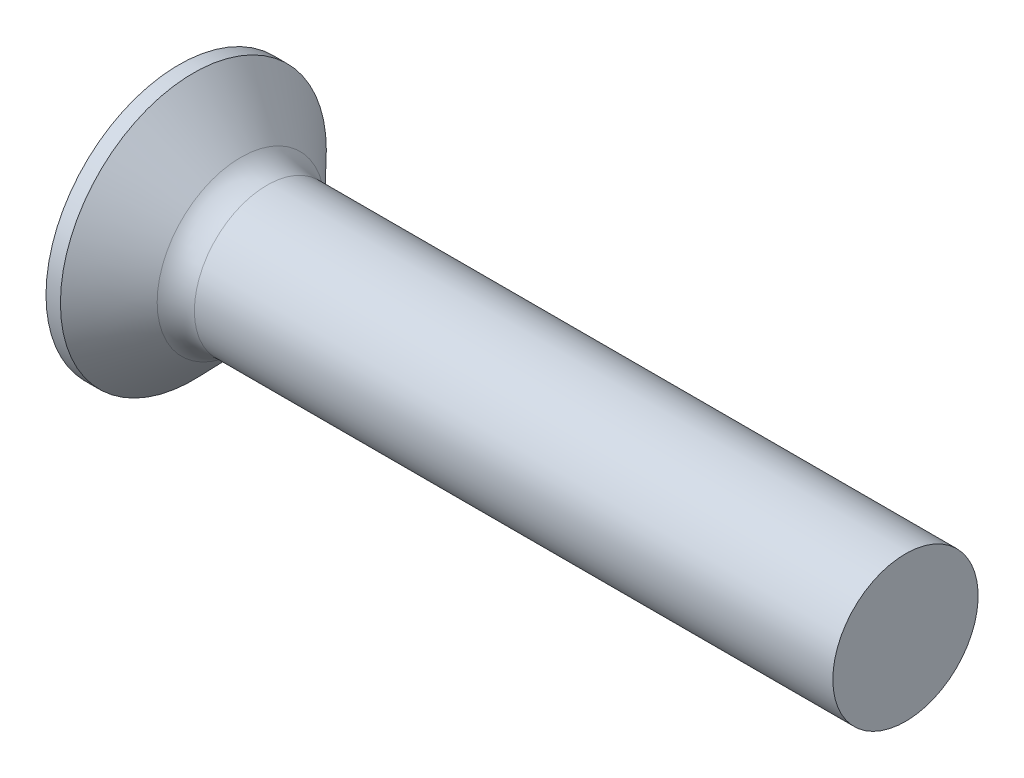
ISO-10303-21;
HEADER;
FILE_DESCRIPTION(('STEP AP214'),'2;1');
FILE_NAME('part.step','',(''),(''),'','','');
FILE_SCHEMA(('AUTOMOTIVE_DESIGN { 1 0 10303 214 1 1 1 1 }'));
ENDSEC;
DATA;
#1=APPLICATION_CONTEXT('core data for automotive mechanical design processes');
#2=APPLICATION_PROTOCOL_DEFINITION('international standard','automotive_design',2000,#1);
#3=PRODUCT_CONTEXT('',#1,'mechanical');
#4=PRODUCT('Part','Part','',(#3));
#5=PRODUCT_RELATED_PRODUCT_CATEGORY('part','',(#4));
#6=PRODUCT_DEFINITION_FORMATION('','',#4);
#7=PRODUCT_DEFINITION_CONTEXT('part definition',#1,'design');
#8=PRODUCT_DEFINITION('design','',#6,#7);
#9=PRODUCT_DEFINITION_SHAPE('','',#8);
#10=(LENGTH_UNIT() NAMED_UNIT(*) SI_UNIT(.MILLI.,.METRE.));
#11=(NAMED_UNIT(*) PLANE_ANGLE_UNIT() SI_UNIT($,.RADIAN.));
#12=(NAMED_UNIT(*) SI_UNIT($,.STERADIAN.) SOLID_ANGLE_UNIT());
#13=UNCERTAINTY_MEASURE_WITH_UNIT(LENGTH_MEASURE(1.E-05),#10,'distance_accuracy_value','');
#14=(GEOMETRIC_REPRESENTATION_CONTEXT(3) GLOBAL_UNCERTAINTY_ASSIGNED_CONTEXT((#13)) GLOBAL_UNIT_ASSIGNED_CONTEXT((#10,
#11,#12)) REPRESENTATION_CONTEXT('',''));
#15=CARTESIAN_POINT('',(0.,0.,0.));
#16=DIRECTION('',(0.,0.,1.));
#17=DIRECTION('',(1.,0.,0.));
#18=AXIS2_PLACEMENT_3D('',#15,#16,#17);
#19=CARTESIAN_POINT('',(19.3505434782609,0.,0.));
#20=DIRECTION('',(-1.,0.,0.));
#21=DIRECTION('',(0.,-1.,0.));
#22=AXIS2_PLACEMENT_3D('',#19,#20,#21);
#23=SPHERICAL_SURFACE('',#22,19.3505434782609);
#24=CARTESIAN_POINT('',(2.3,0.,0.));
#25=DIRECTION('',(-1.,0.,0.));
#26=DIRECTION('',(0.,0.,1.));
#27=AXIS2_PLACEMENT_3D('',#24,#25,#26);
#28=CIRCLE('',#27,9.15);
#29=CARTESIAN_POINT('',(2.3,0.,9.15));
#30=VERTEX_POINT('',#29);
#31=EDGE_CURVE('E203',#30,#30,#28,.T.);
#32=ORIENTED_EDGE('',*,*,#31,.T.);
#33=EDGE_LOOP('',(#32));
#34=FACE_BOUND('',#33,.T.);
#35=CARTESIAN_POINT('',(19.3505434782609,1.08,0.));
#36=DIRECTION('',(0.,-1.,0.));
#37=DIRECTION('',(0.,0.,-1.));
#38=AXIS2_PLACEMENT_3D('',#35,#36,#37);
#39=CIRCLE('',#38,19.3203812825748);
#40=CARTESIAN_POINT('',(0.643432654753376,1.08000000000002,-4.82919636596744));
#41=VERTEX_POINT('',#40);
#42=CARTESIAN_POINT('',(0.142443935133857,1.08000000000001,-2.07991462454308));
#43=VERTEX_POINT('',#42);
#44=EDGE_CURVE('E283',#41,#43,#39,.F.);
#45=ORIENTED_EDGE('',*,*,#44,.T.);
#46=CARTESIAN_POINT('',(0.142443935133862,0.,0.));
#47=DIRECTION('',(1.,0.,0.));
#48=DIRECTION('',(0.,0.,-1.));
#49=AXIS2_PLACEMENT_3D('',#46,#47,#48);
#50=CIRCLE('',#49,2.34359656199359);
#51=CARTESIAN_POINT('',(0.142443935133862,2.07991462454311,-1.08));
#52=VERTEX_POINT('',#51);
#53=EDGE_CURVE('E312',#43,#52,#50,.T.);
#54=ORIENTED_EDGE('',*,*,#53,.T.);
#55=CARTESIAN_POINT('',(19.3505434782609,0.,-1.08));
#56=DIRECTION('',(0.,0.,1.));
#57=DIRECTION('',(0.,-1.,0.));
#58=AXIS2_PLACEMENT_3D('',#55,#56,#57);
#59=CIRCLE('',#58,19.3203812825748);
#60=CARTESIAN_POINT('',(0.643432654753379,4.82919636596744,-1.08));
#61=VERTEX_POINT('',#60);
#62=EDGE_CURVE('E225',#52,#61,#59,.F.);
#63=ORIENTED_EDGE('',*,*,#62,.T.);
#64=CARTESIAN_POINT('',(17.5544828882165,-3.60234084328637,0.));
#65=DIRECTION('',(0.446197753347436,0.894934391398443,0.));
#66=DIRECTION('',(-0.894934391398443,0.446197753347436,0.));
#67=AXIS2_PLACEMENT_3D('',#64,#65,#66);
#68=CIRCLE('',#67,18.9272512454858);
#69=CARTESIAN_POINT('',(0.643432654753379,4.82919636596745,1.08));
#70=VERTEX_POINT('',#69);
#71=EDGE_CURVE('E229',#70,#61,#68,.F.);
#72=ORIENTED_EDGE('',*,*,#71,.F.);
#73=CARTESIAN_POINT('',(19.3505434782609,0.,1.08));
#74=DIRECTION('',(0.,0.,-1.));
#75=DIRECTION('',(-1.,0.,0.));
#76=AXIS2_PLACEMENT_3D('',#73,#74,#75);
#77=CIRCLE('',#76,19.3203812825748);
#78=CARTESIAN_POINT('',(0.142443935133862,2.07991462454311,1.08));
#79=VERTEX_POINT('',#78);
#80=EDGE_CURVE('E222',#70,#79,#77,.F.);
#81=ORIENTED_EDGE('',*,*,#80,.T.);
#82=CARTESIAN_POINT('',(0.142443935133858,1.07999999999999,2.07991462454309));
#83=VERTEX_POINT('',#82);
#84=EDGE_CURVE('E338',#79,#83,#50,.T.);
#85=ORIENTED_EDGE('',*,*,#84,.T.);
#86=CARTESIAN_POINT('',(0.643432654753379,1.07999999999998,4.82919636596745));
#87=VERTEX_POINT('',#86);
#88=EDGE_CURVE('E250',#83,#87,#39,.F.);
#89=ORIENTED_EDGE('',*,*,#88,.T.);
#90=CARTESIAN_POINT('',(17.5544828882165,0.,-3.60234084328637));
#91=DIRECTION('',(0.446197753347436,0.,0.894934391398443));
#92=DIRECTION('',(0.894934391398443,0.,-0.446197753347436));
#93=AXIS2_PLACEMENT_3D('',#90,#91,#92);
#94=CIRCLE('',#93,18.9272512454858);
#95=CARTESIAN_POINT('',(0.643432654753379,-1.08000000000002,4.82919636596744));
#96=VERTEX_POINT('',#95);
#97=EDGE_CURVE('E47',#96,#87,#94,.F.);
#98=ORIENTED_EDGE('',*,*,#97,.F.);
#99=CARTESIAN_POINT('',(19.3505434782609,-1.08,0.));
#100=DIRECTION('',(0.,1.,0.));
#101=DIRECTION('',(0.,0.,1.));
#102=AXIS2_PLACEMENT_3D('',#99,#100,#101);
#103=CIRCLE('',#102,19.3203812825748);
#104=CARTESIAN_POINT('',(0.142443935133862,-1.08000000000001,2.07991462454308));
#105=VERTEX_POINT('',#104);
#106=EDGE_CURVE('E253',#96,#105,#103,.F.);
#107=ORIENTED_EDGE('',*,*,#106,.T.);
#108=CARTESIAN_POINT('',(0.142443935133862,-2.07991462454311,1.08));
#109=VERTEX_POINT('',#108);
#110=EDGE_CURVE('E369',#105,#109,#50,.T.);
#111=ORIENTED_EDGE('',*,*,#110,.T.);
#112=CARTESIAN_POINT('',(0.643432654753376,-4.82919636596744,1.08));
#113=VERTEX_POINT('',#112);
#114=EDGE_CURVE('E221',#109,#113,#77,.F.);
#115=ORIENTED_EDGE('',*,*,#114,.T.);
#116=CARTESIAN_POINT('',(17.5544828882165,3.60234084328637,0.));
#117=DIRECTION('',(0.446197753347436,-0.894934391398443,0.));
#118=DIRECTION('',(0.894934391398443,0.446197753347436,0.));
#119=AXIS2_PLACEMENT_3D('',#116,#117,#118);
#120=CIRCLE('',#119,18.9272512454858);
#121=CARTESIAN_POINT('',(0.643432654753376,-4.82919636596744,-1.08));
#122=VERTEX_POINT('',#121);
#123=EDGE_CURVE('E219',#122,#113,#120,.F.);
#124=ORIENTED_EDGE('',*,*,#123,.F.);
#125=CARTESIAN_POINT('',(0.142443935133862,-2.07991462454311,-1.08));
#126=VERTEX_POINT('',#125);
#127=EDGE_CURVE('E226',#122,#126,#59,.F.);
#128=ORIENTED_EDGE('',*,*,#127,.T.);
#129=CARTESIAN_POINT('',(0.142443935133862,-1.07999999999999,-2.07991462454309));
#130=VERTEX_POINT('',#129);
#131=EDGE_CURVE('E333',#126,#130,#50,.T.);
#132=ORIENTED_EDGE('',*,*,#131,.T.);
#133=CARTESIAN_POINT('',(0.643432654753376,-1.07999999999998,-4.82919636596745));
#134=VERTEX_POINT('',#133);
#135=EDGE_CURVE('E255',#130,#134,#103,.F.);
#136=ORIENTED_EDGE('',*,*,#135,.T.);
#137=CARTESIAN_POINT('',(17.5544828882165,0.,3.60234084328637));
#138=DIRECTION('',(0.446197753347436,0.,-0.894934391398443));
#139=DIRECTION('',(-0.894934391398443,0.,-0.446197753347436));
#140=AXIS2_PLACEMENT_3D('',#137,#138,#139);
#141=CIRCLE('',#140,18.9272512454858);
#142=EDGE_CURVE('E232',#41,#134,#141,.F.);
#143=ORIENTED_EDGE('',*,*,#142,.F.);
#144=EDGE_LOOP('',(#45,#54,#63,#72,#81,#85,#89,#98,#107,#111,#115,#124,#128,#132,#136,#143));
#145=FACE_BOUND('',#144,.T.);
#146=ADVANCED_FACE('F34',(#34,#145),#23,.T.);
#147=CARTESIAN_POINT('',(0.,5.15,-1.08));
#148=DIRECTION('',(0.,0.,1.));
#149=DIRECTION('',(0.,-1.,0.));
#150=AXIS2_PLACEMENT_3D('',#147,#148,#149);
#151=PLANE('',#150);
#152=ORIENTED_EDGE('',*,*,#62,.F.);
#153=CARTESIAN_POINT('',(-3.44355605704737,2.35887117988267,-1.08));
#154=CARTESIAN_POINT('',(-2.7304906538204,2.30401999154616,-1.08));
#155=CARTESIAN_POINT('',(-2.01744868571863,2.24886012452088,-1.08));
#156=CARTESIAN_POINT('',(-0.591414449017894,2.13771480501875,-1.08));
#157=CARTESIAN_POINT('',(0.121577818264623,2.08172933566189,-1.08));
#158=CARTESIAN_POINT('',(1.19100520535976,1.99697742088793,-1.08));
#159=CARTESIAN_POINT('',(1.54747097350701,1.96859781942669,-1.08));
#160=CARTESIAN_POINT('',(2.26037773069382,1.9115430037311,-1.08));
#161=CARTESIAN_POINT('',(2.61681871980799,1.88286779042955,-1.08));
#162=CARTESIAN_POINT('',(3.32966606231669,1.82518005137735,-1.08));
#163=CARTESIAN_POINT('',(3.68607241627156,1.79616753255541,-1.08));
#164=CARTESIAN_POINT('',(4.39885706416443,1.73775165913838,-1.08));
#165=CARTESIAN_POINT('',(4.75523535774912,1.70834830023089,-1.08));
#166=CARTESIAN_POINT('',(5.58663589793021,1.63921941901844,-1.08));
#167=CARTESIAN_POINT('',(6.0616435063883,1.59931748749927,-1.08));
#168=CARTESIAN_POINT('',(7.01157125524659,1.5185088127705,-1.08));
#169=CARTESIAN_POINT('',(7.48649139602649,1.47760207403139,-1.08));
#170=CARTESIAN_POINT('',(8.43619415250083,1.39450876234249,-1.08));
#171=CARTESIAN_POINT('',(8.91097677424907,1.35232225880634,-1.08));
#172=CARTESIAN_POINT('',(9.86039820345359,1.26626057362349,-1.08));
#173=CARTESIAN_POINT('',(10.335037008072,1.2223853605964,-1.08));
#174=CARTESIAN_POINT('',(11.2842082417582,1.13232451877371,-1.08));
#175=CARTESIAN_POINT('',(11.7587406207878,1.0861383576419,-1.08));
#176=CARTESIAN_POINT('',(12.4702723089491,1.01434051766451,-1.08));
#177=CARTESIAN_POINT('',(12.707398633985,0.989988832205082,-1.08));
#178=CARTESIAN_POINT('',(13.1815436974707,0.940232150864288,-1.08));
#179=CARTESIAN_POINT('',(13.4185624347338,0.914827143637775,-1.08));
#180=CARTESIAN_POINT('',(13.8925107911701,0.862671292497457,-1.08));
#181=CARTESIAN_POINT('',(14.1294403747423,0.835920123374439,-1.08));
#182=CARTESIAN_POINT('',(14.6030864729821,0.780644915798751,-1.08));
#183=CARTESIAN_POINT('',(14.8398029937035,0.752120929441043,-1.08));
#184=CARTESIAN_POINT('',(15.3129751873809,0.692614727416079,-1.08));
#185=CARTESIAN_POINT('',(15.5494308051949,0.661632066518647,-1.08));
#186=CARTESIAN_POINT('',(15.903743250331,0.612390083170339,-1.08));
#187=CARTESIAN_POINT('',(16.0217913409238,0.59551386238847,-1.08));
#188=CARTESIAN_POINT('',(16.2577108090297,0.560543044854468,-1.08));
#189=CARTESIAN_POINT('',(16.3755821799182,0.542448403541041,-1.08));
#190=CARTESIAN_POINT('',(16.4933362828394,0.523597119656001,-1.08));
#191=B_SPLINE_CURVE_WITH_KNOTS('',3,(#153,#154,#155,#156,#157,#158,#159,#160,#161,#162,#163,
#164,#165,#166,#167,#168,#169,#170,#171,#172,#173,#174,#175,#176,#177,#178,#179,#180,#181,#182,
#183,#184,#185,#186,#187,#188,#189,#190),.UNSPECIFIED.,.F.,.F.,(4,2,2,2,2,2,2,2,2,2,2,2,2,2,2,2,
2,2,4),(0.,2.14551628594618,4.29107649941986,5.36385745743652,6.43663503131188,7.50939060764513,
8.58215803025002,10.0121989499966,11.44223350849,12.8721906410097,14.302174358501,
15.7324890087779,16.4476075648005,17.1627338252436,17.8780336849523,18.59331253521,
19.3087212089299,19.6664605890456,20.0242130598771),.UNSPECIFIED.);
#192=CARTESIAN_POINT('',(6.05,1.60013444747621,-1.08));
#193=VERTEX_POINT('',#192);
#194=EDGE_CURVE('E358',#52,#193,#191,.T.);
#195=ORIENTED_EDGE('',*,*,#194,.T.);
#196=DIRECTION('',(0.,1.,0.));
#197=VECTOR('',#196,1.);
#198=CARTESIAN_POINT('',(6.05,-2.13358177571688,-1.08));
#199=LINE('',#198,#197);
#200=CARTESIAN_POINT('',(6.05,2.13358177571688,-1.08));
#201=VERTEX_POINT('',#200);
#202=EDGE_CURVE('E303',#193,#201,#199,.T.);
#203=ORIENTED_EDGE('',*,*,#202,.T.);
#204=DIRECTION('',(0.894934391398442,-0.446197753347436,0.));
#205=VECTOR('',#204,1.);
#206=CARTESIAN_POINT('',(0.,5.15,-1.08));
#207=LINE('',#206,#205);
#208=EDGE_CURVE('E200',#61,#201,#207,.T.);
#209=ORIENTED_EDGE('',*,*,#208,.F.);
#210=EDGE_LOOP('',(#152,#195,#203,#209));
#211=FACE_BOUND('',#210,.T.);
#212=ADVANCED_FACE('F168',(#211),#151,.T.);
#213=CARTESIAN_POINT('',(6.05,-2.13358177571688,-1.08));
#214=VERTEX_POINT('',#213);
#215=CARTESIAN_POINT('',(6.05,-1.60013444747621,-1.08));
#216=VERTEX_POINT('',#215);
#217=EDGE_CURVE('E209',#214,#216,#199,.T.);
#218=ORIENTED_EDGE('',*,*,#217,.T.);
#219=CARTESIAN_POINT('',(-3.44355604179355,-2.35887117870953,-1.08));
#220=CARTESIAN_POINT('',(-2.73049064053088,-2.30401999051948,-1.08));
#221=CARTESIAN_POINT('',(-2.01744867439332,-2.24886012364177,-1.08));
#222=CARTESIAN_POINT('',(-0.591414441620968,-2.13771480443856,-1.08));
#223=CARTESIAN_POINT('',(0.121577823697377,-2.08172933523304,-1.08));
#224=CARTESIAN_POINT('',(1.19100520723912,-1.99697742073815,-1.08));
#225=CARTESIAN_POINT('',(1.54747097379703,-1.96859781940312,-1.08));
#226=CARTESIAN_POINT('',(2.26037772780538,-1.91154300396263,-1.08));
#227=CARTESIAN_POINT('',(2.61681871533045,-1.88286779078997,-1.08));
#228=CARTESIAN_POINT('',(3.32966605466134,-1.8251800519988,-1.08));
#229=CARTESIAN_POINT('',(3.6860724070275,-1.79616753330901,-1.08));
#230=CARTESIAN_POINT('',(4.39885705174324,-1.73775166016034,-1.08));
#231=CARTESIAN_POINT('',(4.7552353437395,-1.70834830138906,-1.08));
#232=CARTESIAN_POINT('',(5.58663588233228,-1.63921942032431,-1.08));
#233=CARTESIAN_POINT('',(6.06164349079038,-1.59931748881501,-1.08));
#234=CARTESIAN_POINT('',(7.01157123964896,-1.51850881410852,-1.08));
#235=CARTESIAN_POINT('',(7.48649138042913,-1.47760207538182,-1.08));
#236=CARTESIAN_POINT('',(8.43619413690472,-1.39450876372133,-1.08));
#237=CARTESIAN_POINT('',(8.91097675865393,-1.35232226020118,-1.08));
#238=CARTESIAN_POINT('',(9.86039818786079,-1.26626057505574,-1.08));
#239=CARTESIAN_POINT('',(10.3350369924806,-1.22238536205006,-1.08));
#240=CARTESIAN_POINT('',(11.2842082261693,-1.13232452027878,-1.08));
#241=CARTESIAN_POINT('',(11.7587406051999,-1.08613835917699,-1.08));
#242=CARTESIAN_POINT('',(12.4702722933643,-1.01434051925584,-1.08));
#243=CARTESIAN_POINT('',(12.7073986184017,-0.989988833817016,-1.08));
#244=CARTESIAN_POINT('',(13.1815436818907,-0.940232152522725,-1.08));
#245=CARTESIAN_POINT('',(13.4185624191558,-0.914827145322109,-1.08));
#246=CARTESIAN_POINT('',(13.8925107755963,-0.862671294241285,-1.08));
#247=CARTESIAN_POINT('',(14.1294403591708,-0.835920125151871,-1.08));
#248=CARTESIAN_POINT('',(14.6030864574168,-0.780644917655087,-1.08));
#249=CARTESIAN_POINT('',(14.8398029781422,-0.752120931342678,-1.08));
#250=CARTESIAN_POINT('',(15.3129751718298,-0.692614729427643,-1.08));
#251=CARTESIAN_POINT('',(15.54943078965,-0.66163206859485,-1.08));
#252=CARTESIAN_POINT('',(15.9037432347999,-0.612390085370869,-1.08));
#253=CARTESIAN_POINT('',(16.021791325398,-0.595513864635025,-1.08));
#254=CARTESIAN_POINT('',(16.2577107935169,-0.560543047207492,-1.08));
#255=CARTESIAN_POINT('',(16.3755821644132,-0.542448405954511,-1.08));
#256=CARTESIAN_POINT('',(16.4933362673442,-0.523597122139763,-1.08));
#257=B_SPLINE_CURVE_WITH_KNOTS('',3,(#219,#220,#221,#222,#223,#224,#225,#226,#227,#228,#229,
#230,#231,#232,#233,#234,#235,#236,#237,#238,#239,#240,#241,#242,#243,#244,#245,#246,#247,#248,
#249,#250,#251,#252,#253,#254,#255,#256),.UNSPECIFIED.,.F.,.F.,(4,2,2,2,2,2,2,2,2,2,2,2,2,2,2,2,
2,2,4),(0.,2.14551628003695,4.29107648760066,5.36385744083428,6.43663500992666,7.50939058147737,
8.58215799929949,10.0121989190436,11.4422334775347,12.872190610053,14.3021743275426,
15.732488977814,16.4476075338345,17.1627337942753,17.8780336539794,18.5933125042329,
19.3087211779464,19.6664605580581,20.0242130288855),.UNSPECIFIED.);
#258=EDGE_CURVE('E337',#216,#126,#257,.F.);
#259=ORIENTED_EDGE('',*,*,#258,.T.);
#260=ORIENTED_EDGE('',*,*,#127,.F.);
#261=DIRECTION('',(0.894934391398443,0.446197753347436,0.));
#262=VECTOR('',#261,1.);
#263=CARTESIAN_POINT('',(0.,-5.15,-1.08));
#264=LINE('',#263,#262);
#265=EDGE_CURVE('E62',#122,#214,#264,.T.);
#266=ORIENTED_EDGE('',*,*,#265,.T.);
#267=EDGE_LOOP('',(#218,#259,#260,#266));
#268=FACE_BOUND('',#267,.T.);
#269=ADVANCED_FACE('F174',(#268),#151,.T.);
#270=CARTESIAN_POINT('',(0.,-5.15,1.08));
#271=DIRECTION('',(0.,0.,-1.));
#272=DIRECTION('',(-1.,0.,0.));
#273=AXIS2_PLACEMENT_3D('',#270,#271,#272);
#274=PLANE('',#273);
#275=DIRECTION('',(0.,-1.,0.));
#276=VECTOR('',#275,1.);
#277=CARTESIAN_POINT('',(6.05,2.13358177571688,1.08));
#278=LINE('',#277,#276);
#279=CARTESIAN_POINT('',(6.05,2.13358177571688,1.08));
#280=VERTEX_POINT('',#279);
#281=CARTESIAN_POINT('',(6.05,1.60013444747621,1.08));
#282=VERTEX_POINT('',#281);
#283=EDGE_CURVE('E293',#280,#282,#278,.T.);
#284=ORIENTED_EDGE('',*,*,#283,.T.);
#285=CARTESIAN_POINT('',(-3.44355604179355,2.35887117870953,1.08));
#286=CARTESIAN_POINT('',(-2.73049064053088,2.30401999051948,1.08));
#287=CARTESIAN_POINT('',(-2.01744867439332,2.24886012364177,1.08));
#288=CARTESIAN_POINT('',(-0.591414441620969,2.13771480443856,1.08));
#289=CARTESIAN_POINT('',(0.121577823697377,2.08172933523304,1.08));
#290=CARTESIAN_POINT('',(1.19100520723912,1.99697742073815,1.08));
#291=CARTESIAN_POINT('',(1.54747097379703,1.96859781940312,1.08));
#292=CARTESIAN_POINT('',(2.26037772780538,1.91154300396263,1.08));
#293=CARTESIAN_POINT('',(2.61681871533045,1.88286779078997,1.08));
#294=CARTESIAN_POINT('',(3.32966605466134,1.8251800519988,1.08));
#295=CARTESIAN_POINT('',(3.6860724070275,1.79616753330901,1.08));
#296=CARTESIAN_POINT('',(4.39885705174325,1.73775166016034,1.08));
#297=CARTESIAN_POINT('',(4.7552353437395,1.70834830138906,1.08));
#298=CARTESIAN_POINT('',(5.58663588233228,1.63921942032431,1.08));
#299=CARTESIAN_POINT('',(6.06164349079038,1.59931748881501,1.08));
#300=CARTESIAN_POINT('',(7.01157123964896,1.51850881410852,1.08));
#301=CARTESIAN_POINT('',(7.48649138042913,1.47760207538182,1.08));
#302=CARTESIAN_POINT('',(8.43619413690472,1.39450876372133,1.08));
#303=CARTESIAN_POINT('',(8.91097675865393,1.35232226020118,1.08));
#304=CARTESIAN_POINT('',(9.86039818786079,1.26626057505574,1.08));
#305=CARTESIAN_POINT('',(10.3350369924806,1.22238536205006,1.08));
#306=CARTESIAN_POINT('',(11.2842082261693,1.13232452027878,1.08));
#307=CARTESIAN_POINT('',(11.7587406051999,1.08613835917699,1.08));
#308=CARTESIAN_POINT('',(12.4702722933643,1.01434051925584,1.08));
#309=CARTESIAN_POINT('',(12.7073986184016,0.989988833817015,1.08));
#310=CARTESIAN_POINT('',(13.1815436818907,0.940232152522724,1.08));
#311=CARTESIAN_POINT('',(13.4185624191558,0.914827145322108,1.08));
#312=CARTESIAN_POINT('',(13.8925107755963,0.862671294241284,1.08));
#313=CARTESIAN_POINT('',(14.1294403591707,0.835920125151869,1.08));
#314=CARTESIAN_POINT('',(14.6030864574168,0.780644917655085,1.08));
#315=CARTESIAN_POINT('',(14.8398029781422,0.752120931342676,1.08));
#316=CARTESIAN_POINT('',(15.3129751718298,0.69261472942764,1.08));
#317=CARTESIAN_POINT('',(15.54943078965,0.661632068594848,1.08));
#318=CARTESIAN_POINT('',(15.9037432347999,0.612390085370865,1.08));
#319=CARTESIAN_POINT('',(16.021791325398,0.595513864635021,1.08));
#320=CARTESIAN_POINT('',(16.2577107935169,0.560543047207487,1.08));
#321=CARTESIAN_POINT('',(16.3755821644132,0.542448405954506,1.08));
#322=CARTESIAN_POINT('',(16.4933362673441,0.523597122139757,1.08));
#323=B_SPLINE_CURVE_WITH_KNOTS('',3,(#285,#286,#287,#288,#289,#290,#291,#292,#293,#294,#295,
#296,#297,#298,#299,#300,#301,#302,#303,#304,#305,#306,#307,#308,#309,#310,#311,#312,#313,#314,
#315,#316,#317,#318,#319,#320,#321,#322),.UNSPECIFIED.,.F.,.F.,(4,2,2,2,2,2,2,2,2,2,2,2,2,2,2,2,
2,2,4),(0.,2.14551628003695,4.29107648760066,5.36385744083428,6.43663500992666,7.50939058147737,
8.58215799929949,10.0121989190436,11.4422334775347,12.872190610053,14.3021743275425,
15.732488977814,16.4476075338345,17.1627337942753,17.8780336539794,18.5933125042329,
19.3087211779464,19.6664605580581,20.0242130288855),.UNSPECIFIED.);
#324=EDGE_CURVE('E260',#282,#79,#323,.F.);
#325=ORIENTED_EDGE('',*,*,#324,.T.);
#326=ORIENTED_EDGE('',*,*,#80,.F.);
#327=DIRECTION('',(0.894934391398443,-0.446197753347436,0.));
#328=VECTOR('',#327,1.);
#329=CARTESIAN_POINT('',(0.,5.15,1.08));
#330=LINE('',#329,#328);
#331=EDGE_CURVE('E206',#70,#280,#330,.T.);
#332=ORIENTED_EDGE('',*,*,#331,.T.);
#333=EDGE_LOOP('',(#284,#325,#326,#332));
#334=FACE_BOUND('',#333,.T.);
#335=ADVANCED_FACE('F354',(#334),#274,.T.);
#336=ORIENTED_EDGE('',*,*,#114,.F.);
#337=CARTESIAN_POINT('',(-3.44355604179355,-2.35887117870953,1.08));
#338=CARTESIAN_POINT('',(-2.73049064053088,-2.30401999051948,1.08));
#339=CARTESIAN_POINT('',(-2.01744867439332,-2.24886012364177,1.08));
#340=CARTESIAN_POINT('',(-0.59141444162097,-2.13771480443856,1.08));
#341=CARTESIAN_POINT('',(0.121577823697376,-2.08172933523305,1.08));
#342=CARTESIAN_POINT('',(1.19100520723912,-1.99697742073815,1.08));
#343=CARTESIAN_POINT('',(1.54747097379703,-1.96859781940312,1.08));
#344=CARTESIAN_POINT('',(2.26037772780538,-1.91154300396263,1.08));
#345=CARTESIAN_POINT('',(2.61681871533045,-1.88286779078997,1.08));
#346=CARTESIAN_POINT('',(3.32966605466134,-1.8251800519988,1.08));
#347=CARTESIAN_POINT('',(3.6860724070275,-1.79616753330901,1.08));
#348=CARTESIAN_POINT('',(4.39885705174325,-1.73775166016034,1.08));
#349=CARTESIAN_POINT('',(4.7552353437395,-1.70834830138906,1.08));
#350=CARTESIAN_POINT('',(5.58663588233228,-1.63921942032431,1.08));
#351=CARTESIAN_POINT('',(6.06164349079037,-1.59931748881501,1.08));
#352=CARTESIAN_POINT('',(7.01157123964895,-1.51850881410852,1.08));
#353=CARTESIAN_POINT('',(7.48649138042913,-1.47760207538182,1.08));
#354=CARTESIAN_POINT('',(8.43619413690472,-1.39450876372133,1.08));
#355=CARTESIAN_POINT('',(8.91097675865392,-1.35232226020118,1.08));
#356=CARTESIAN_POINT('',(9.86039818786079,-1.26626057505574,1.08));
#357=CARTESIAN_POINT('',(10.3350369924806,-1.22238536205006,1.08));
#358=CARTESIAN_POINT('',(11.2842082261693,-1.13232452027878,1.08));
#359=CARTESIAN_POINT('',(11.7587406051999,-1.08613835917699,1.08));
#360=CARTESIAN_POINT('',(12.4702722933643,-1.01434051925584,1.08));
#361=CARTESIAN_POINT('',(12.7073986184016,-0.989988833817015,1.08));
#362=CARTESIAN_POINT('',(13.1815436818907,-0.940232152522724,1.08));
#363=CARTESIAN_POINT('',(13.4185624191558,-0.914827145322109,1.08));
#364=CARTESIAN_POINT('',(13.8925107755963,-0.862671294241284,1.08));
#365=CARTESIAN_POINT('',(14.1294403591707,-0.835920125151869,1.08));
#366=CARTESIAN_POINT('',(14.6030864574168,-0.780644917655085,1.08));
#367=CARTESIAN_POINT('',(14.8398029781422,-0.752120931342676,1.08));
#368=CARTESIAN_POINT('',(15.3129751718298,-0.692614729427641,1.08));
#369=CARTESIAN_POINT('',(15.54943078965,-0.661632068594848,1.08));
#370=CARTESIAN_POINT('',(15.9037432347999,-0.612390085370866,1.08));
#371=CARTESIAN_POINT('',(16.021791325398,-0.595513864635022,1.08));
#372=CARTESIAN_POINT('',(16.2577107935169,-0.560543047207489,1.08));
#373=CARTESIAN_POINT('',(16.3755821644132,-0.542448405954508,1.08));
#374=CARTESIAN_POINT('',(16.4933362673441,-0.523597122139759,1.08));
#375=B_SPLINE_CURVE_WITH_KNOTS('',3,(#337,#338,#339,#340,#341,#342,#343,#344,#345,#346,#347,
#348,#349,#350,#351,#352,#353,#354,#355,#356,#357,#358,#359,#360,#361,#362,#363,#364,#365,#366,
#367,#368,#369,#370,#371,#372,#373,#374),.UNSPECIFIED.,.F.,.F.,(4,2,2,2,2,2,2,2,2,2,2,2,2,2,2,2,
2,2,4),(0.,2.14551628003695,4.29107648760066,5.36385744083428,6.43663500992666,7.50939058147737,
8.58215799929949,10.0121989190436,11.4422334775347,12.872190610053,14.3021743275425,
15.732488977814,16.4476075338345,17.1627337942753,17.8780336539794,18.5933125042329,
19.3087211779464,19.6664605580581,20.0242130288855),.UNSPECIFIED.);
#376=CARTESIAN_POINT('',(6.05,-1.60013444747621,1.08));
#377=VERTEX_POINT('',#376);
#378=EDGE_CURVE('E370',#109,#377,#375,.T.);
#379=ORIENTED_EDGE('',*,*,#378,.T.);
#380=CARTESIAN_POINT('',(6.05,-2.13358177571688,1.08));
#381=VERTEX_POINT('',#380);
#382=EDGE_CURVE('E295',#377,#381,#278,.T.);
#383=ORIENTED_EDGE('',*,*,#382,.T.);
#384=DIRECTION('',(0.894934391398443,0.446197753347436,0.));
#385=VECTOR('',#384,1.);
#386=CARTESIAN_POINT('',(0.,-5.15,1.08));
#387=LINE('',#386,#385);
#388=EDGE_CURVE('E287',#113,#381,#387,.T.);
#389=ORIENTED_EDGE('',*,*,#388,.F.);
#390=EDGE_LOOP('',(#336,#379,#383,#389));
#391=FACE_BOUND('',#390,.T.);
#392=ADVANCED_FACE('F472',(#391),#274,.T.);
#393=CARTESIAN_POINT('',(6.05,2.13358177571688,-1.08));
#394=DIRECTION('',(-1.,0.,0.));
#395=DIRECTION('',(0.,0.,1.));
#396=AXIS2_PLACEMENT_3D('',#393,#394,#395);
#397=PLANE('',#396);
#398=ORIENTED_EDGE('',*,*,#382,.F.);
#399=CARTESIAN_POINT('',(6.05,0.,0.));
#400=DIRECTION('',(-1.,0.,0.));
#401=DIRECTION('',(0.,0.,1.));
#402=AXIS2_PLACEMENT_3D('',#399,#400,#401);
#403=CIRCLE('',#402,1.9305);
#404=EDGE_CURVE('E330',#216,#377,#403,.T.);
#405=ORIENTED_EDGE('',*,*,#404,.F.);
#406=ORIENTED_EDGE('',*,*,#217,.F.);
#407=DIRECTION('',(0.,0.,1.));
#408=VECTOR('',#407,1.);
#409=CARTESIAN_POINT('',(6.05,-2.13358177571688,-1.08));
#410=LINE('',#409,#408);
#411=EDGE_CURVE('E290',#214,#381,#410,.T.);
#412=ORIENTED_EDGE('',*,*,#411,.T.);
#413=EDGE_LOOP('',(#398,#405,#406,#412));
#414=FACE_BOUND('',#413,.T.);
#415=ADVANCED_FACE('F399',(#414),#397,.T.);
#416=DIRECTION('',(0.,0.,-1.));
#417=VECTOR('',#416,1.);
#418=CARTESIAN_POINT('',(6.05,-1.08000000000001,2.13358177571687));
#419=LINE('',#418,#417);
#420=CARTESIAN_POINT('',(6.05,-1.07999999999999,-1.60013444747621));
#421=VERTEX_POINT('',#420);
#422=CARTESIAN_POINT('',(6.05,-1.07999999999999,-2.13358177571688));
#423=VERTEX_POINT('',#422);
#424=EDGE_CURVE('E277',#421,#423,#419,.T.);
#425=ORIENTED_EDGE('',*,*,#424,.F.);
#426=CARTESIAN_POINT('',(6.05,1.08000000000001,-1.60013444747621));
#427=VERTEX_POINT('',#426);
#428=EDGE_CURVE('E54',#427,#421,#403,.T.);
#429=ORIENTED_EDGE('',*,*,#428,.F.);
#430=DIRECTION('',(0.,0.,1.));
#431=VECTOR('',#430,1.);
#432=CARTESIAN_POINT('',(6.05,1.08000000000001,-2.13358177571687));
#433=LINE('',#432,#431);
#434=CARTESIAN_POINT('',(6.05,1.08000000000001,-2.13358177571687));
#435=VERTEX_POINT('',#434);
#436=EDGE_CURVE('E280',#435,#427,#433,.T.);
#437=ORIENTED_EDGE('',*,*,#436,.F.);
#438=DIRECTION('',(0.,-1.,0.));
#439=VECTOR('',#438,1.);
#440=CARTESIAN_POINT('',(6.05,1.08000000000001,-2.13358177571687));
#441=LINE('',#440,#439);
#442=EDGE_CURVE('E271',#435,#423,#441,.T.);
#443=ORIENTED_EDGE('',*,*,#442,.T.);
#444=EDGE_LOOP('',(#425,#429,#437,#443));
#445=FACE_BOUND('',#444,.T.);
#446=ADVANCED_FACE('F325',(#445),#397,.T.);
#447=ORIENTED_EDGE('',*,*,#202,.F.);
#448=EDGE_CURVE('E329',#282,#193,#403,.T.);
#449=ORIENTED_EDGE('',*,*,#448,.F.);
#450=ORIENTED_EDGE('',*,*,#283,.F.);
#451=DIRECTION('',(0.,0.,-1.));
#452=VECTOR('',#451,1.);
#453=CARTESIAN_POINT('',(6.05,2.13358177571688,1.08));
#454=LINE('',#453,#452);
#455=EDGE_CURVE('E296',#280,#201,#454,.T.);
#456=ORIENTED_EDGE('',*,*,#455,.T.);
#457=EDGE_LOOP('',(#447,#449,#450,#456));
#458=FACE_BOUND('',#457,.T.);
#459=ADVANCED_FACE('F400',(#458),#397,.T.);
#460=CARTESIAN_POINT('',(0.,1.07999999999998,5.15));
#461=DIRECTION('',(0.,-1.,0.));
#462=DIRECTION('',(0.,0.,-1.));
#463=AXIS2_PLACEMENT_3D('',#460,#461,#462);
#464=PLANE('',#463);
#465=ORIENTED_EDGE('',*,*,#88,.F.);
#466=CARTESIAN_POINT('',(-3.44355605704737,1.07999999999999,2.35887117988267));
#467=CARTESIAN_POINT('',(-2.7304906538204,1.07999999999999,2.30401999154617));
#468=CARTESIAN_POINT('',(-2.01744868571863,1.07999999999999,2.24886012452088));
#469=CARTESIAN_POINT('',(-0.591414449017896,1.07999999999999,2.13771480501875));
#470=CARTESIAN_POINT('',(0.121577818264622,1.07999999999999,2.0817293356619));
#471=CARTESIAN_POINT('',(1.19100520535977,1.07999999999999,1.99697742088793));
#472=CARTESIAN_POINT('',(1.54747097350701,1.07999999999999,1.9685978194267));
#473=CARTESIAN_POINT('',(2.26037773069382,1.07999999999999,1.91154300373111));
#474=CARTESIAN_POINT('',(2.616818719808,1.07999999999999,1.88286779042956));
#475=CARTESIAN_POINT('',(3.32966606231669,1.07999999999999,1.82518005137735));
#476=CARTESIAN_POINT('',(3.68607241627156,1.07999999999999,1.79616753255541));
#477=CARTESIAN_POINT('',(4.39885706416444,1.07999999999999,1.73775165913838));
#478=CARTESIAN_POINT('',(4.75523535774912,1.07999999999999,1.7083483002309));
#479=CARTESIAN_POINT('',(5.58663589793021,1.07999999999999,1.63921941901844));
#480=CARTESIAN_POINT('',(6.0616435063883,1.07999999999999,1.59931748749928));
#481=CARTESIAN_POINT('',(7.01157125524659,1.07999999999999,1.5185088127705));
#482=CARTESIAN_POINT('',(7.48649139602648,1.07999999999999,1.47760207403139));
#483=CARTESIAN_POINT('',(8.43619415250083,1.07999999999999,1.39450876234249));
#484=CARTESIAN_POINT('',(8.91097677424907,1.07999999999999,1.35232225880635));
#485=CARTESIAN_POINT('',(9.86039820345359,1.08,1.2662605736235));
#486=CARTESIAN_POINT('',(10.335037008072,1.08,1.2223853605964));
#487=CARTESIAN_POINT('',(11.2842082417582,1.08,1.13232451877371));
#488=CARTESIAN_POINT('',(11.7587406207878,1.08,1.08613835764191));
#489=CARTESIAN_POINT('',(12.4702723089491,1.08,1.01434051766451));
#490=CARTESIAN_POINT('',(12.707398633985,1.08,0.989988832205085));
#491=CARTESIAN_POINT('',(13.1815436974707,1.08,0.940232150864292));
#492=CARTESIAN_POINT('',(13.4185624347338,1.08,0.914827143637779));
#493=CARTESIAN_POINT('',(13.8925107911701,1.08,0.86267129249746));
#494=CARTESIAN_POINT('',(14.1294403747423,1.08,0.835920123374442));
#495=CARTESIAN_POINT('',(14.6030864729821,1.08,0.780644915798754));
#496=CARTESIAN_POINT('',(14.8398029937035,1.08,0.752120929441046));
#497=CARTESIAN_POINT('',(15.3129751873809,1.08,0.692614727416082));
#498=CARTESIAN_POINT('',(15.5494308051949,1.08,0.66163206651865));
#499=CARTESIAN_POINT('',(15.903743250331,1.08,0.612390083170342));
#500=CARTESIAN_POINT('',(16.0217913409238,1.08,0.595513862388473));
#501=CARTESIAN_POINT('',(16.2577108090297,1.08,0.560543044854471));
#502=CARTESIAN_POINT('',(16.3755821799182,1.08,0.542448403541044));
#503=CARTESIAN_POINT('',(16.4933362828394,1.08,0.523597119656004));
#504=B_SPLINE_CURVE_WITH_KNOTS('',3,(#466,#467,#468,#469,#470,#471,#472,#473,#474,#475,#476,
#477,#478,#479,#480,#481,#482,#483,#484,#485,#486,#487,#488,#489,#490,#491,#492,#493,#494,#495,
#496,#497,#498,#499,#500,#501,#502,#503),.UNSPECIFIED.,.F.,.F.,(4,2,2,2,2,2,2,2,2,2,2,2,2,2,2,2,
2,2,4),(0.,2.14551628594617,4.29107649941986,5.36385745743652,6.43663503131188,7.50939060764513,
8.58215803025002,10.0121989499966,11.44223350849,12.8721906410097,14.302174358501,
15.7324890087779,16.4476075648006,17.1627338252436,17.8780336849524,18.59331253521,
19.3087212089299,19.6664605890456,20.0242130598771),.UNSPECIFIED.);
#505=CARTESIAN_POINT('',(6.05,1.07999999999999,1.60013444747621));
#506=VERTEX_POINT('',#505);
#507=EDGE_CURVE('E547',#83,#506,#504,.T.);
#508=ORIENTED_EDGE('',*,*,#507,.T.);
#509=CARTESIAN_POINT('',(6.05,1.07999999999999,2.13358177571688));
#510=VERTEX_POINT('',#509);
#511=EDGE_CURVE('E252',#506,#510,#433,.T.);
#512=ORIENTED_EDGE('',*,*,#511,.T.);
#513=DIRECTION('',(0.894934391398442,0.,-0.446197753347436));
#514=VECTOR('',#513,1.);
#515=CARTESIAN_POINT('',(0.,1.07999999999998,5.15));
#516=LINE('',#515,#514);
#517=EDGE_CURVE('E242',#87,#510,#516,.T.);
#518=ORIENTED_EDGE('',*,*,#517,.F.);
#519=EDGE_LOOP('',(#465,#508,#512,#518));
#520=FACE_BOUND('',#519,.T.);
#521=ADVANCED_FACE('F248',(#520),#464,.T.);
#522=CARTESIAN_POINT('',(0.,-1.07999999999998,-5.15));
#523=DIRECTION('',(0.,1.,0.));
#524=DIRECTION('',(-1.,0.,0.));
#525=AXIS2_PLACEMENT_3D('',#522,#523,#524);
#526=PLANE('',#525);
#527=CARTESIAN_POINT('',(6.05,-1.08000000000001,2.13358177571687));
#528=VERTEX_POINT('',#527);
#529=CARTESIAN_POINT('',(6.05,-1.08000000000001,1.60013444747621));
#530=VERTEX_POINT('',#529);
#531=EDGE_CURVE('E274',#528,#530,#419,.T.);
#532=ORIENTED_EDGE('',*,*,#531,.T.);
#533=CARTESIAN_POINT('',(-3.44355605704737,-1.08000000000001,2.35887117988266));
#534=CARTESIAN_POINT('',(-2.7304906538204,-1.08000000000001,2.30401999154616));
#535=CARTESIAN_POINT('',(-2.01744868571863,-1.08000000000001,2.24886012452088));
#536=CARTESIAN_POINT('',(-0.591414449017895,-1.08000000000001,2.13771480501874));
#537=CARTESIAN_POINT('',(0.121577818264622,-1.08000000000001,2.08172933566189));
#538=CARTESIAN_POINT('',(1.19100520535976,-1.08000000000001,1.99697742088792));
#539=CARTESIAN_POINT('',(1.54747097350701,-1.08000000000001,1.96859781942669));
#540=CARTESIAN_POINT('',(2.26037773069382,-1.08000000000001,1.9115430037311));
#541=CARTESIAN_POINT('',(2.616818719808,-1.08000000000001,1.88286779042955));
#542=CARTESIAN_POINT('',(3.32966606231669,-1.08000000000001,1.82518005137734));
#543=CARTESIAN_POINT('',(3.68607241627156,-1.08000000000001,1.7961675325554));
#544=CARTESIAN_POINT('',(4.39885706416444,-1.08000000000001,1.73775165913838));
#545=CARTESIAN_POINT('',(4.75523535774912,-1.08000000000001,1.70834830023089));
#546=CARTESIAN_POINT('',(5.58663589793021,-1.08000000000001,1.63921941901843));
#547=CARTESIAN_POINT('',(6.0616435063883,-1.08000000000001,1.59931748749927));
#548=CARTESIAN_POINT('',(7.01157125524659,-1.08000000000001,1.5185088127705));
#549=CARTESIAN_POINT('',(7.48649139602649,-1.08000000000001,1.47760207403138));
#550=CARTESIAN_POINT('',(8.43619415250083,-1.08000000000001,1.39450876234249));
#551=CARTESIAN_POINT('',(8.91097677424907,-1.08000000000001,1.35232225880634));
#552=CARTESIAN_POINT('',(9.86039820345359,-1.08000000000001,1.26626057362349));
#553=CARTESIAN_POINT('',(10.335037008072,-1.08000000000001,1.2223853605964));
#554=CARTESIAN_POINT('',(11.2842082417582,-1.08000000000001,1.1323245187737));
#555=CARTESIAN_POINT('',(11.7587406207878,-1.08000000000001,1.0861383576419));
#556=CARTESIAN_POINT('',(12.4702723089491,-1.08000000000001,1.0143405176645));
#557=CARTESIAN_POINT('',(12.707398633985,-1.08,0.989988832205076));
#558=CARTESIAN_POINT('',(13.1815436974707,-1.08,0.940232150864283));
#559=CARTESIAN_POINT('',(13.4185624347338,-1.08,0.914827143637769));
#560=CARTESIAN_POINT('',(13.8925107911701,-1.08,0.86267129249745));
#561=CARTESIAN_POINT('',(14.1294403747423,-1.08,0.835920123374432));
#562=CARTESIAN_POINT('',(14.6030864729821,-1.08,0.780644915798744));
#563=CARTESIAN_POINT('',(14.8398029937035,-1.08,0.752120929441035));
#564=CARTESIAN_POINT('',(15.3129751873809,-1.08,0.692614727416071));
#565=CARTESIAN_POINT('',(15.5494308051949,-1.08,0.661632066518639));
#566=CARTESIAN_POINT('',(15.903743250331,-1.08,0.61239008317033));
#567=CARTESIAN_POINT('',(16.0217913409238,-1.08,0.59551386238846));
#568=CARTESIAN_POINT('',(16.2577108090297,-1.08,0.560543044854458));
#569=CARTESIAN_POINT('',(16.3755821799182,-1.08,0.542448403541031));
#570=CARTESIAN_POINT('',(16.4933362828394,-1.08,0.523597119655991));
#571=B_SPLINE_CURVE_WITH_KNOTS('',3,(#533,#534,#535,#536,#537,#538,#539,#540,#541,#542,#543,
#544,#545,#546,#547,#548,#549,#550,#551,#552,#553,#554,#555,#556,#557,#558,#559,#560,#561,#562,
#563,#564,#565,#566,#567,#568,#569,#570),.UNSPECIFIED.,.F.,.F.,(4,2,2,2,2,2,2,2,2,2,2,2,2,2,2,2,
2,2,4),(0.,2.14551628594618,4.29107649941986,5.36385745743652,6.43663503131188,7.50939060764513,
8.58215803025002,10.0121989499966,11.44223350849,12.8721906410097,14.302174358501,
15.7324890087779,16.4476075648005,17.1627338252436,17.8780336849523,18.59331253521,
19.3087212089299,19.6664605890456,20.0242130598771),.UNSPECIFIED.);
#572=EDGE_CURVE('E363',#530,#105,#571,.F.);
#573=ORIENTED_EDGE('',*,*,#572,.T.);
#574=ORIENTED_EDGE('',*,*,#106,.F.);
#575=DIRECTION('',(0.894934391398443,0.,-0.446197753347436));
#576=VECTOR('',#575,1.);
#577=CARTESIAN_POINT('',(0.,-1.08000000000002,5.15));
#578=LINE('',#577,#576);
#579=EDGE_CURVE('E244',#96,#528,#578,.T.);
#580=ORIENTED_EDGE('',*,*,#579,.T.);
#581=EDGE_LOOP('',(#532,#573,#574,#580));
#582=FACE_BOUND('',#581,.T.);
#583=ADVANCED_FACE('F194',(#582),#526,.T.);
#584=ORIENTED_EDGE('',*,*,#436,.T.);
#585=CARTESIAN_POINT('',(-3.44355605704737,1.08000000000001,-2.35887117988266));
#586=CARTESIAN_POINT('',(-2.7304906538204,1.08000000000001,-2.30401999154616));
#587=CARTESIAN_POINT('',(-2.01744868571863,1.08000000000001,-2.24886012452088));
#588=CARTESIAN_POINT('',(-0.591414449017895,1.08000000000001,-2.13771480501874));
#589=CARTESIAN_POINT('',(0.121577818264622,1.08000000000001,-2.08172933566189));
#590=CARTESIAN_POINT('',(1.19100520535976,1.08000000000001,-1.99697742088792));
#591=CARTESIAN_POINT('',(1.54747097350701,1.08000000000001,-1.96859781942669));
#592=CARTESIAN_POINT('',(2.26037773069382,1.08000000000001,-1.9115430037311));
#593=CARTESIAN_POINT('',(2.61681871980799,1.08000000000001,-1.88286779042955));
#594=CARTESIAN_POINT('',(3.32966606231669,1.08000000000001,-1.82518005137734));
#595=CARTESIAN_POINT('',(3.68607241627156,1.08000000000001,-1.7961675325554));
#596=CARTESIAN_POINT('',(4.39885706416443,1.08000000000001,-1.73775165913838));
#597=CARTESIAN_POINT('',(4.75523535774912,1.08000000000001,-1.70834830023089));
#598=CARTESIAN_POINT('',(5.58663589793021,1.08000000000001,-1.63921941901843));
#599=CARTESIAN_POINT('',(6.06164350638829,1.08000000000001,-1.59931748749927));
#600=CARTESIAN_POINT('',(7.01157125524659,1.08000000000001,-1.5185088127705));
#601=CARTESIAN_POINT('',(7.48649139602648,1.08000000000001,-1.47760207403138));
#602=CARTESIAN_POINT('',(8.43619415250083,1.08,-1.39450876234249));
#603=CARTESIAN_POINT('',(8.91097677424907,1.08,-1.35232225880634));
#604=CARTESIAN_POINT('',(9.86039820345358,1.08,-1.26626057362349));
#605=CARTESIAN_POINT('',(10.335037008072,1.08,-1.2223853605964));
#606=CARTESIAN_POINT('',(11.2842082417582,1.08,-1.1323245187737));
#607=CARTESIAN_POINT('',(11.7587406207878,1.08,-1.0861383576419));
#608=CARTESIAN_POINT('',(12.4702723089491,1.08,-1.01434051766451));
#609=CARTESIAN_POINT('',(12.707398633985,1.08,-0.989988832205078));
#610=CARTESIAN_POINT('',(13.1815436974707,1.08,-0.940232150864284));
#611=CARTESIAN_POINT('',(13.4185624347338,1.08,-0.914827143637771));
#612=CARTESIAN_POINT('',(13.8925107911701,1.08,-0.862671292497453));
#613=CARTESIAN_POINT('',(14.1294403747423,1.08,-0.835920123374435));
#614=CARTESIAN_POINT('',(14.6030864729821,1.08,-0.780644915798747));
#615=CARTESIAN_POINT('',(14.8398029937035,1.08,-0.752120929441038));
#616=CARTESIAN_POINT('',(15.3129751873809,1.08,-0.692614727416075));
#617=CARTESIAN_POINT('',(15.5494308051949,1.08,-0.661632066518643));
#618=CARTESIAN_POINT('',(15.903743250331,1.08,-0.612390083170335));
#619=CARTESIAN_POINT('',(16.0217913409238,1.08,-0.595513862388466));
#620=CARTESIAN_POINT('',(16.2577108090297,1.08,-0.560543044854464));
#621=CARTESIAN_POINT('',(16.3755821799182,1.08,-0.542448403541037));
#622=CARTESIAN_POINT('',(16.4933362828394,1.08,-0.523597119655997));
#623=B_SPLINE_CURVE_WITH_KNOTS('',3,(#585,#586,#587,#588,#589,#590,#591,#592,#593,#594,#595,
#596,#597,#598,#599,#600,#601,#602,#603,#604,#605,#606,#607,#608,#609,#610,#611,#612,#613,#614,
#615,#616,#617,#618,#619,#620,#621,#622),.UNSPECIFIED.,.F.,.F.,(4,2,2,2,2,2,2,2,2,2,2,2,2,2,2,2,
2,2,4),(0.,2.14551628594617,4.29107649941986,5.36385745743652,6.43663503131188,7.50939060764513,
8.58215803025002,10.0121989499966,11.44223350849,12.8721906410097,14.302174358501,
15.7324890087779,16.4476075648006,17.1627338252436,17.8780336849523,18.59331253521,
19.3087212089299,19.6664605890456,20.0242130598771),.UNSPECIFIED.);
#624=EDGE_CURVE('E318',#427,#43,#623,.F.);
#625=ORIENTED_EDGE('',*,*,#624,.T.);
#626=ORIENTED_EDGE('',*,*,#44,.F.);
#627=DIRECTION('',(0.894934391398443,0.,0.446197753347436));
#628=VECTOR('',#627,1.);
#629=CARTESIAN_POINT('',(0.,1.08000000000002,-5.15));
#630=LINE('',#629,#628);
#631=EDGE_CURVE('E257',#41,#435,#630,.T.);
#632=ORIENTED_EDGE('',*,*,#631,.T.);
#633=EDGE_LOOP('',(#584,#625,#626,#632));
#634=FACE_BOUND('',#633,.T.);
#635=ADVANCED_FACE('F192',(#634),#464,.T.);
#636=ORIENTED_EDGE('',*,*,#135,.F.);
#637=CARTESIAN_POINT('',(-3.44355605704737,-1.07999999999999,-2.35887117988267));
#638=CARTESIAN_POINT('',(-2.7304906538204,-1.07999999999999,-2.30401999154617));
#639=CARTESIAN_POINT('',(-2.01744868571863,-1.07999999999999,-2.24886012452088));
#640=CARTESIAN_POINT('',(-0.591414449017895,-1.07999999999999,-2.13771480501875));
#641=CARTESIAN_POINT('',(0.121577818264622,-1.07999999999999,-2.0817293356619));
#642=CARTESIAN_POINT('',(1.19100520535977,-1.07999999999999,-1.99697742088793));
#643=CARTESIAN_POINT('',(1.54747097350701,-1.07999999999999,-1.9685978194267));
#644=CARTESIAN_POINT('',(2.26037773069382,-1.07999999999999,-1.91154300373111));
#645=CARTESIAN_POINT('',(2.616818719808,-1.07999999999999,-1.88286779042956));
#646=CARTESIAN_POINT('',(3.32966606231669,-1.07999999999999,-1.82518005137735));
#647=CARTESIAN_POINT('',(3.68607241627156,-1.07999999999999,-1.79616753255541));
#648=CARTESIAN_POINT('',(4.39885706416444,-1.07999999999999,-1.73775165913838));
#649=CARTESIAN_POINT('',(4.75523535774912,-1.07999999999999,-1.7083483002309));
#650=CARTESIAN_POINT('',(5.58663589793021,-1.07999999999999,-1.63921941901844));
#651=CARTESIAN_POINT('',(6.0616435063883,-1.07999999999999,-1.59931748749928));
#652=CARTESIAN_POINT('',(7.01157125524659,-1.07999999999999,-1.5185088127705));
#653=CARTESIAN_POINT('',(7.48649139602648,-1.07999999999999,-1.47760207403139));
#654=CARTESIAN_POINT('',(8.43619415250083,-1.08,-1.39450876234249));
#655=CARTESIAN_POINT('',(8.91097677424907,-1.08,-1.35232225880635));
#656=CARTESIAN_POINT('',(9.86039820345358,-1.08,-1.26626057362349));
#657=CARTESIAN_POINT('',(10.335037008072,-1.08,-1.2223853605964));
#658=CARTESIAN_POINT('',(11.2842082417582,-1.08,-1.13232451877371));
#659=CARTESIAN_POINT('',(11.7587406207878,-1.08,-1.0861383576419));
#660=CARTESIAN_POINT('',(12.4702723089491,-1.08,-1.01434051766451));
#661=CARTESIAN_POINT('',(12.707398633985,-1.08,-0.989988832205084));
#662=CARTESIAN_POINT('',(13.1815436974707,-1.08,-0.940232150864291));
#663=CARTESIAN_POINT('',(13.4185624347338,-1.08,-0.914827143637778));
#664=CARTESIAN_POINT('',(13.8925107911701,-1.08,-0.862671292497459));
#665=CARTESIAN_POINT('',(14.1294403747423,-1.08,-0.835920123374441));
#666=CARTESIAN_POINT('',(14.6030864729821,-1.08,-0.780644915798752));
#667=CARTESIAN_POINT('',(14.8398029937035,-1.08,-0.752120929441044));
#668=CARTESIAN_POINT('',(15.3129751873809,-1.08,-0.692614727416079));
#669=CARTESIAN_POINT('',(15.5494308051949,-1.08,-0.661632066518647));
#670=CARTESIAN_POINT('',(15.903743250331,-1.08,-0.612390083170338));
#671=CARTESIAN_POINT('',(16.0217913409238,-1.08,-0.595513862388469));
#672=CARTESIAN_POINT('',(16.2577108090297,-1.08,-0.560543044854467));
#673=CARTESIAN_POINT('',(16.3755821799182,-1.08,-0.54244840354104));
#674=CARTESIAN_POINT('',(16.4933362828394,-1.08,-0.523597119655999));
#675=B_SPLINE_CURVE_WITH_KNOTS('',3,(#637,#638,#639,#640,#641,#642,#643,#644,#645,#646,#647,
#648,#649,#650,#651,#652,#653,#654,#655,#656,#657,#658,#659,#660,#661,#662,#663,#664,#665,#666,
#667,#668,#669,#670,#671,#672,#673,#674),.UNSPECIFIED.,.F.,.F.,(4,2,2,2,2,2,2,2,2,2,2,2,2,2,2,2,
2,2,4),(0.,2.14551628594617,4.29107649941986,5.36385745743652,6.43663503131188,7.50939060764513,
8.58215803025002,10.0121989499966,11.44223350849,12.8721906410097,14.302174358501,
15.7324890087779,16.4476075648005,17.1627338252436,17.8780336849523,18.59331253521,
19.3087212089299,19.6664605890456,20.0242130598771),.UNSPECIFIED.);
#676=EDGE_CURVE('E11',#130,#421,#675,.T.);
#677=ORIENTED_EDGE('',*,*,#676,.T.);
#678=ORIENTED_EDGE('',*,*,#424,.T.);
#679=DIRECTION('',(0.894934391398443,0.,0.446197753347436));
#680=VECTOR('',#679,1.);
#681=CARTESIAN_POINT('',(0.,-1.07999999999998,-5.15));
#682=LINE('',#681,#680);
#683=EDGE_CURVE('E268',#134,#423,#682,.T.);
#684=ORIENTED_EDGE('',*,*,#683,.F.);
#685=EDGE_LOOP('',(#636,#677,#678,#684));
#686=FACE_BOUND('',#685,.T.);
#687=ADVANCED_FACE('F184',(#686),#526,.T.);
#688=CARTESIAN_POINT('',(52.3,0.,0.));
#689=DIRECTION('',(-1.,0.,0.));
#690=DIRECTION('',(0.,0.,1.));
#691=AXIS2_PLACEMENT_3D('',#688,#689,#690);
#692=PLANE('',#691);
#693=CARTESIAN_POINT('',(52.3,0.,0.));
#694=DIRECTION('',(-1.,0.,0.));
#695=DIRECTION('',(0.,0.,1.));
#696=AXIS2_PLACEMENT_3D('',#693,#694,#695);
#697=CIRCLE('',#696,5.);
#698=CARTESIAN_POINT('',(52.3,0.,5.));
#699=VERTEX_POINT('',#698);
#700=EDGE_CURVE('E197',#699,#699,#697,.T.);
#701=ORIENTED_EDGE('',*,*,#700,.F.);
#702=EDGE_LOOP('',(#701));
#703=FACE_BOUND('',#702,.T.);
#704=ADVANCED_FACE('F182',(#703),#692,.F.);
#705=CARTESIAN_POINT('',(-15.875,0.,0.));
#706=DIRECTION('',(-1.,0.,0.));
#707=DIRECTION('',(0.,0.,1.));
#708=AXIS2_PLACEMENT_3D('',#705,#706,#707);
#709=CYLINDRICAL_SURFACE('',#708,9.15);
#710=ORIENTED_EDGE('',*,*,#31,.F.);
#711=EDGE_LOOP('',(#710));
#712=FACE_BOUND('',#711,.T.);
#713=CARTESIAN_POINT('',(3.29239158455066,0.,0.));
#714=DIRECTION('',(-1.,0.,0.));
#715=DIRECTION('',(0.,0.,1.));
#716=AXIS2_PLACEMENT_3D('',#713,#714,#715);
#717=CIRCLE('',#716,9.15);
#718=CARTESIAN_POINT('',(3.29239158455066,0.,9.15));
#719=VERTEX_POINT('',#718);
#720=EDGE_CURVE('E199',#719,#719,#717,.T.);
#721=ORIENTED_EDGE('',*,*,#720,.T.);
#722=EDGE_LOOP('',(#721));
#723=FACE_BOUND('',#722,.T.);
#724=ADVANCED_FACE('F180',(#712,#723),#709,.T.);
#725=CARTESIAN_POINT('',(3.29239158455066,0.,0.));
#726=DIRECTION('',(-1.,0.,0.));
#727=DIRECTION('',(0.,0.,1.));
#728=AXIS2_PLACEMENT_3D('',#725,#726,#727);
#729=CONICAL_SURFACE('',#728,9.15,0.802851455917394);
#730=CARTESIAN_POINT('',(6.56283753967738,0.,0.));
#731=DIRECTION('',(1.,0.,0.));
#732=DIRECTION('',(0.,0.,-1.));
#733=AXIS2_PLACEMENT_3D('',#730,#731,#732);
#734=CIRCLE('',#733,5.76335407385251);
#735=CARTESIAN_POINT('',(6.56283753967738,0.,-5.76335407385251));
#736=VERTEX_POINT('',#735);
#737=EDGE_CURVE('E213',#736,#736,#734,.F.);
#738=ORIENTED_EDGE('',*,*,#737,.T.);
#739=EDGE_LOOP('',(#738));
#740=FACE_BOUND('',#739,.T.);
#741=ORIENTED_EDGE('',*,*,#720,.F.);
#742=EDGE_LOOP('',(#741));
#743=FACE_BOUND('',#742,.T.);
#744=ADVANCED_FACE('F190',(#740,#743),#729,.T.);
#745=CARTESIAN_POINT('',(-15.875,0.,0.));
#746=DIRECTION('',(-1.,0.,0.));
#747=DIRECTION('',(0.,0.,1.));
#748=AXIS2_PLACEMENT_3D('',#745,#746,#747);
#749=CYLINDRICAL_SURFACE('',#748,5.);
#750=CARTESIAN_POINT('',(8.36118704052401,0.,0.));
#751=DIRECTION('',(-1.,0.,0.));
#752=DIRECTION('',(0.,0.,1.));
#753=AXIS2_PLACEMENT_3D('',#750,#751,#752);
#754=CIRCLE('',#753,5.);
#755=CARTESIAN_POINT('',(8.36118704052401,0.,5.));
#756=VERTEX_POINT('',#755);
#757=EDGE_CURVE('E216',#756,#756,#754,.F.);
#758=ORIENTED_EDGE('',*,*,#757,.T.);
#759=EDGE_LOOP('',(#758));
#760=FACE_BOUND('',#759,.T.);
#761=ORIENTED_EDGE('',*,*,#700,.T.);
#762=EDGE_LOOP('',(#761));
#763=FACE_BOUND('',#762,.T.);
#764=ADVANCED_FACE('F401',(#760,#763),#749,.T.);
#765=CARTESIAN_POINT('',(8.36118704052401,0.,0.));
#766=DIRECTION('',(-1.,0.,0.));
#767=DIRECTION('',(0.,0.,1.));
#768=AXIS2_PLACEMENT_3D('',#765,#766,#767);
#769=TOROIDAL_SURFACE('',#768,7.5,2.5);
#770=ORIENTED_EDGE('',*,*,#757,.F.);
#771=EDGE_LOOP('',(#770));
#772=FACE_BOUND('',#771,.T.);
#773=ORIENTED_EDGE('',*,*,#737,.F.);
#774=EDGE_LOOP('',(#773));
#775=FACE_BOUND('',#774,.T.);
#776=ADVANCED_FACE('F36',(#772,#775),#769,.F.);
#777=ORIENTED_EDGE('',*,*,#511,.F.);
#778=EDGE_CURVE('E334',#530,#506,#403,.T.);
#779=ORIENTED_EDGE('',*,*,#778,.F.);
#780=ORIENTED_EDGE('',*,*,#531,.F.);
#781=DIRECTION('',(0.,1.,0.));
#782=VECTOR('',#781,1.);
#783=CARTESIAN_POINT('',(6.05,-1.08000000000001,2.13358177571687));
#784=LINE('',#783,#782);
#785=EDGE_CURVE('E278',#528,#510,#784,.T.);
#786=ORIENTED_EDGE('',*,*,#785,.T.);
#787=EDGE_LOOP('',(#777,#779,#780,#786));
#788=FACE_BOUND('',#787,.T.);
#789=ADVANCED_FACE('F393',(#788),#397,.T.);
#790=CARTESIAN_POINT('',(6.05,2.13358177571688,1.08));
#791=DIRECTION('',(0.446197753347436,0.894934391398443,0.));
#792=DIRECTION('',(-0.894934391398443,0.446197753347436,0.));
#793=AXIS2_PLACEMENT_3D('',#790,#791,#792);
#794=PLANE('',#793);
#795=ORIENTED_EDGE('',*,*,#71,.T.);
#796=ORIENTED_EDGE('',*,*,#208,.T.);
#797=ORIENTED_EDGE('',*,*,#455,.F.);
#798=ORIENTED_EDGE('',*,*,#331,.F.);
#799=EDGE_LOOP('',(#795,#796,#797,#798));
#800=FACE_BOUND('',#799,.T.);
#801=ADVANCED_FACE('F352',(#800),#794,.F.);
#802=CARTESIAN_POINT('',(0.,-5.15,-1.08));
#803=DIRECTION('',(0.446197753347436,-0.894934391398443,0.));
#804=DIRECTION('',(0.894934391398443,0.446197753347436,0.));
#805=AXIS2_PLACEMENT_3D('',#802,#803,#804);
#806=PLANE('',#805);
#807=ORIENTED_EDGE('',*,*,#123,.T.);
#808=ORIENTED_EDGE('',*,*,#388,.T.);
#809=ORIENTED_EDGE('',*,*,#411,.F.);
#810=ORIENTED_EDGE('',*,*,#265,.F.);
#811=EDGE_LOOP('',(#807,#808,#809,#810));
#812=FACE_BOUND('',#811,.T.);
#813=ADVANCED_FACE('F386',(#812),#806,.F.);
#814=CARTESIAN_POINT('',(6.05,-1.08000000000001,2.13358177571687));
#815=DIRECTION('',(0.446197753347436,0.,0.894934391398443));
#816=DIRECTION('',(-0.894934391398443,0.,0.446197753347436));
#817=AXIS2_PLACEMENT_3D('',#814,#815,#816);
#818=PLANE('',#817);
#819=ORIENTED_EDGE('',*,*,#97,.T.);
#820=ORIENTED_EDGE('',*,*,#517,.T.);
#821=ORIENTED_EDGE('',*,*,#785,.F.);
#822=ORIENTED_EDGE('',*,*,#579,.F.);
#823=EDGE_LOOP('',(#819,#820,#821,#822));
#824=FACE_BOUND('',#823,.T.);
#825=ADVANCED_FACE('F240',(#824),#818,.F.);
#826=CARTESIAN_POINT('',(0.,1.08000000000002,-5.15));
#827=DIRECTION('',(0.446197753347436,0.,-0.894934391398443));
#828=DIRECTION('',(0.894934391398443,0.,0.446197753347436));
#829=AXIS2_PLACEMENT_3D('',#826,#827,#828);
#830=PLANE('',#829);
#831=ORIENTED_EDGE('',*,*,#142,.T.);
#832=ORIENTED_EDGE('',*,*,#683,.T.);
#833=ORIENTED_EDGE('',*,*,#442,.F.);
#834=ORIENTED_EDGE('',*,*,#631,.F.);
#835=EDGE_LOOP('',(#831,#832,#833,#834));
#836=FACE_BOUND('',#835,.T.);
#837=ADVANCED_FACE('F320',(#836),#830,.F.);
#838=CARTESIAN_POINT('',(6.05,0.,0.));
#839=DIRECTION('',(-1.,0.,0.));
#840=DIRECTION('',(0.,0.,1.));
#841=AXIS2_PLACEMENT_3D('',#838,#839,#840);
#842=CONICAL_SURFACE('',#841,1.9305,0.069813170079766);
#843=EDGE_CURVE('E331',#506,#282,#403,.T.);
#844=ORIENTED_EDGE('',*,*,#843,.F.);
#845=ORIENTED_EDGE('',*,*,#507,.F.);
#846=ORIENTED_EDGE('',*,*,#84,.F.);
#847=ORIENTED_EDGE('',*,*,#324,.F.);
#848=EDGE_LOOP('',(#844,#845,#846,#847));
#849=FACE_BOUND('',#848,.T.);
#850=ADVANCED_FACE('F165',(#849),#842,.F.);
#851=ORIENTED_EDGE('',*,*,#110,.F.);
#852=ORIENTED_EDGE('',*,*,#572,.F.);
#853=EDGE_CURVE('E556',#377,#530,#403,.T.);
#854=ORIENTED_EDGE('',*,*,#853,.F.);
#855=ORIENTED_EDGE('',*,*,#378,.F.);
#856=EDGE_LOOP('',(#851,#852,#854,#855));
#857=FACE_BOUND('',#856,.T.);
#858=ADVANCED_FACE('F384',(#857),#842,.F.);
#859=ORIENTED_EDGE('',*,*,#53,.F.);
#860=ORIENTED_EDGE('',*,*,#624,.F.);
#861=EDGE_CURVE('E326',#193,#427,#403,.T.);
#862=ORIENTED_EDGE('',*,*,#861,.F.);
#863=ORIENTED_EDGE('',*,*,#194,.F.);
#864=EDGE_LOOP('',(#859,#860,#862,#863));
#865=FACE_BOUND('',#864,.T.);
#866=ADVANCED_FACE('F163',(#865),#842,.F.);
#867=EDGE_CURVE('E327',#421,#216,#403,.T.);
#868=ORIENTED_EDGE('',*,*,#867,.F.);
#869=ORIENTED_EDGE('',*,*,#676,.F.);
#870=ORIENTED_EDGE('',*,*,#131,.F.);
#871=ORIENTED_EDGE('',*,*,#258,.F.);
#872=EDGE_LOOP('',(#868,#869,#870,#871));
#873=FACE_BOUND('',#872,.T.);
#874=ADVANCED_FACE('F158',(#873),#842,.F.);
#875=CARTESIAN_POINT('',(6.67725747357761,0.,0.));
#876=DIRECTION('',(-1.,0.,0.));
#877=DIRECTION('',(0.,0.,1.));
#878=AXIS2_PLACEMENT_3D('',#875,#876,#877);
#879=CONICAL_SURFACE('',#878,0.,1.25663706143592);
#880=ORIENTED_EDGE('',*,*,#843,.T.);
#881=ORIENTED_EDGE('',*,*,#448,.T.);
#882=ORIENTED_EDGE('',*,*,#861,.T.);
#883=ORIENTED_EDGE('',*,*,#428,.T.);
#884=ORIENTED_EDGE('',*,*,#867,.T.);
#885=ORIENTED_EDGE('',*,*,#404,.T.);
#886=ORIENTED_EDGE('',*,*,#853,.T.);
#887=ORIENTED_EDGE('',*,*,#778,.T.);
#888=EDGE_LOOP('',(#880,#881,#882,#883,#884,#885,#886,#887));
#889=FACE_BOUND('',#888,.T.);
#890=CARTESIAN_POINT('',(6.67725747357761,0.,0.));
#891=VERTEX_POINT('',#890);
#892=VERTEX_LOOP('',#891);
#893=FACE_BOUND('',#892,.T.);
#894=ADVANCED_FACE('F156',(#889,#893),#879,.F.);
#895=CLOSED_SHELL('',(#146,#212,#269,#335,#392,#415,#446,#459,#521,#583,#635,#687,#704,#724,
#744,#764,#776,#789,#801,#813,#825,#837,#850,#858,#866,#874,#894));
#896=MANIFOLD_SOLID_BREP('B2',#895);
#897=ADVANCED_BREP_SHAPE_REPRESENTATION('',(#18,#896),#14);
#898=SHAPE_DEFINITION_REPRESENTATION(#9,#897);
ENDSEC;
END-ISO-10303-21;
